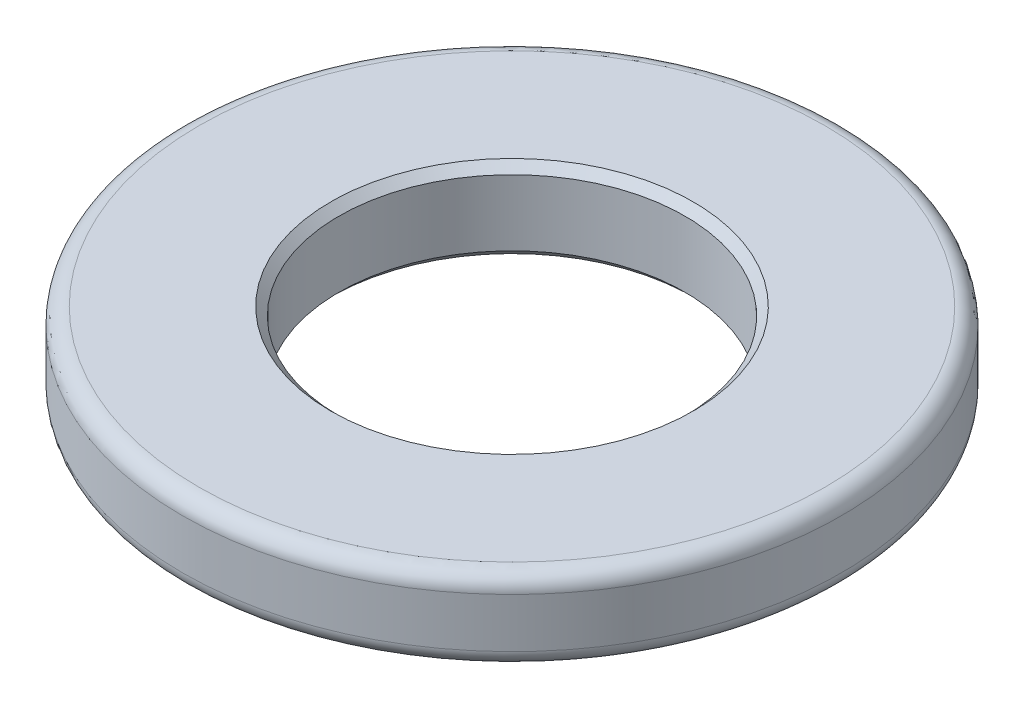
ISO-10303-21;
HEADER;
FILE_DESCRIPTION(('STEP AP214'),'2;1');
FILE_NAME('part.step','',(''),(''),'','','');
FILE_SCHEMA(('AUTOMOTIVE_DESIGN { 1 0 10303 214 1 1 1 1 }'));
ENDSEC;
DATA;
#1=APPLICATION_CONTEXT('core data for automotive mechanical design processes');
#2=APPLICATION_PROTOCOL_DEFINITION('international standard','automotive_design',2000,#1);
#3=PRODUCT_CONTEXT('',#1,'mechanical');
#4=PRODUCT('Part','Part','',(#3));
#5=PRODUCT_RELATED_PRODUCT_CATEGORY('part','',(#4));
#6=PRODUCT_DEFINITION_FORMATION('','',#4);
#7=PRODUCT_DEFINITION_CONTEXT('part definition',#1,'design');
#8=PRODUCT_DEFINITION('design','',#6,#7);
#9=PRODUCT_DEFINITION_SHAPE('','',#8);
#10=(LENGTH_UNIT() NAMED_UNIT(*) SI_UNIT(.MILLI.,.METRE.));
#11=(NAMED_UNIT(*) PLANE_ANGLE_UNIT() SI_UNIT($,.RADIAN.));
#12=(NAMED_UNIT(*) SI_UNIT($,.STERADIAN.) SOLID_ANGLE_UNIT());
#13=UNCERTAINTY_MEASURE_WITH_UNIT(LENGTH_MEASURE(1.E-05),#10,'distance_accuracy_value','');
#14=(GEOMETRIC_REPRESENTATION_CONTEXT(3) GLOBAL_UNCERTAINTY_ASSIGNED_CONTEXT((#13)) GLOBAL_UNIT_ASSIGNED_CONTEXT((#10,
#11,#12)) REPRESENTATION_CONTEXT('',''));
#15=CARTESIAN_POINT('',(0.,0.,0.));
#16=DIRECTION('',(0.,0.,1.));
#17=DIRECTION('',(1.,0.,0.));
#18=AXIS2_PLACEMENT_3D('',#15,#16,#17);
#19=CARTESIAN_POINT('',(0.,1.,0.));
#20=DIRECTION('',(0.,1.,0.));
#21=DIRECTION('',(0.,0.,1.));
#22=AXIS2_PLACEMENT_3D('',#19,#20,#21);
#23=PLANE('',#22);
#24=CARTESIAN_POINT('',(0.,1.,0.));
#25=DIRECTION('',(0.,1.,0.));
#26=DIRECTION('',(0.,0.,1.));
#27=AXIS2_PLACEMENT_3D('',#24,#25,#26);
#28=CIRCLE('',#27,2.2);
#29=CARTESIAN_POINT('',(0.,1.,2.2));
#30=VERTEX_POINT('',#29);
#31=EDGE_CURVE('E10',#30,#30,#28,.F.);
#32=ORIENTED_EDGE('',*,*,#31,.T.);
#33=EDGE_LOOP('',(#32));
#34=FACE_BOUND('',#33,.T.);
#35=CARTESIAN_POINT('',(0.,1.,0.));
#36=DIRECTION('',(0.,1.,0.));
#37=DIRECTION('',(0.,0.,1.));
#38=AXIS2_PLACEMENT_3D('',#35,#36,#37);
#39=CIRCLE('',#38,3.8);
#40=CARTESIAN_POINT('',(0.,1.,3.8));
#41=VERTEX_POINT('',#40);
#42=EDGE_CURVE('E48',#41,#41,#39,.T.);
#43=ORIENTED_EDGE('',*,*,#42,.T.);
#44=EDGE_LOOP('',(#43));
#45=FACE_BOUND('',#44,.T.);
#46=ADVANCED_FACE('F28',(#34,#45),#23,.T.);
#47=CARTESIAN_POINT('',(0.,0.,0.));
#48=DIRECTION('',(0.,1.,0.));
#49=DIRECTION('',(0.,0.,1.));
#50=AXIS2_PLACEMENT_3D('',#47,#48,#49);
#51=PLANE('',#50);
#52=CARTESIAN_POINT('',(0.,0.,0.));
#53=DIRECTION('',(0.,1.,0.));
#54=DIRECTION('',(0.,0.,1.));
#55=AXIS2_PLACEMENT_3D('',#52,#53,#54);
#56=CIRCLE('',#55,2.2);
#57=CARTESIAN_POINT('',(0.,0.,2.2));
#58=VERTEX_POINT('',#57);
#59=EDGE_CURVE('E43',#58,#58,#56,.T.);
#60=ORIENTED_EDGE('',*,*,#59,.T.);
#61=EDGE_LOOP('',(#60));
#62=FACE_BOUND('',#61,.T.);
#63=CARTESIAN_POINT('',(0.,0.,0.));
#64=DIRECTION('',(0.,1.,0.));
#65=DIRECTION('',(0.,0.,1.));
#66=AXIS2_PLACEMENT_3D('',#63,#64,#65);
#67=CIRCLE('',#66,3.8);
#68=CARTESIAN_POINT('',(0.,0.,3.8));
#69=VERTEX_POINT('',#68);
#70=EDGE_CURVE('E51',#69,#69,#67,.F.);
#71=ORIENTED_EDGE('',*,*,#70,.T.);
#72=EDGE_LOOP('',(#71));
#73=FACE_BOUND('',#72,.T.);
#74=ADVANCED_FACE('F72',(#62,#73),#51,.F.);
#75=CARTESIAN_POINT('',(0.,1.,0.));
#76=DIRECTION('',(0.,-1.,0.));
#77=DIRECTION('',(0.,0.,-1.));
#78=AXIS2_PLACEMENT_3D('',#75,#76,#77);
#79=CYLINDRICAL_SURFACE('',#78,4.);
#80=CARTESIAN_POINT('',(0.,0.2,0.));
#81=DIRECTION('',(0.,1.,0.));
#82=DIRECTION('',(0.,0.,1.));
#83=AXIS2_PLACEMENT_3D('',#80,#81,#82);
#84=CIRCLE('',#83,4.);
#85=CARTESIAN_POINT('',(0.,0.2,4.));
#86=VERTEX_POINT('',#85);
#87=EDGE_CURVE('E54',#86,#86,#84,.T.);
#88=ORIENTED_EDGE('',*,*,#87,.T.);
#89=EDGE_LOOP('',(#88));
#90=FACE_BOUND('',#89,.T.);
#91=CARTESIAN_POINT('',(0.,0.8,0.));
#92=DIRECTION('',(0.,1.,0.));
#93=DIRECTION('',(0.,0.,1.));
#94=AXIS2_PLACEMENT_3D('',#91,#92,#93);
#95=CIRCLE('',#94,4.);
#96=CARTESIAN_POINT('',(0.,0.8,4.));
#97=VERTEX_POINT('',#96);
#98=EDGE_CURVE('E57',#97,#97,#95,.F.);
#99=ORIENTED_EDGE('',*,*,#98,.T.);
#100=EDGE_LOOP('',(#99));
#101=FACE_BOUND('',#100,.T.);
#102=ADVANCED_FACE('F61',(#90,#101),#79,.T.);
#103=CARTESIAN_POINT('',(0.,1.,0.));
#104=DIRECTION('',(0.,-1.,0.));
#105=DIRECTION('',(0.,0.,-1.));
#106=AXIS2_PLACEMENT_3D('',#103,#104,#105);
#107=CYLINDRICAL_SURFACE('',#106,2.1);
#108=CARTESIAN_POINT('',(0.,0.099999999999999,0.));
#109=DIRECTION('',(0.,1.,0.));
#110=DIRECTION('',(0.,0.,1.));
#111=AXIS2_PLACEMENT_3D('',#108,#109,#110);
#112=CIRCLE('',#111,2.1);
#113=CARTESIAN_POINT('',(0.,0.099999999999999,2.1));
#114=VERTEX_POINT('',#113);
#115=EDGE_CURVE('E35',#114,#114,#112,.F.);
#116=ORIENTED_EDGE('',*,*,#115,.T.);
#117=EDGE_LOOP('',(#116));
#118=FACE_BOUND('',#117,.T.);
#119=CARTESIAN_POINT('',(0.,0.900000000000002,0.));
#120=DIRECTION('',(0.,1.,0.));
#121=DIRECTION('',(0.,0.,1.));
#122=AXIS2_PLACEMENT_3D('',#119,#120,#121);
#123=CIRCLE('',#122,2.1);
#124=CARTESIAN_POINT('',(0.,0.900000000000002,2.1));
#125=VERTEX_POINT('',#124);
#126=EDGE_CURVE('E39',#125,#125,#123,.T.);
#127=ORIENTED_EDGE('',*,*,#126,.T.);
#128=EDGE_LOOP('',(#127));
#129=FACE_BOUND('',#128,.T.);
#130=ADVANCED_FACE('F80',(#118,#129),#107,.F.);
#131=CARTESIAN_POINT('',(0.,0.2,0.));
#132=DIRECTION('',(0.,1.,0.));
#133=DIRECTION('',(0.,0.,1.));
#134=AXIS2_PLACEMENT_3D('',#131,#132,#133);
#135=TOROIDAL_SURFACE('',#134,3.8,0.2);
#136=ORIENTED_EDGE('',*,*,#70,.F.);
#137=EDGE_LOOP('',(#136));
#138=FACE_BOUND('',#137,.T.);
#139=ORIENTED_EDGE('',*,*,#87,.F.);
#140=EDGE_LOOP('',(#139));
#141=FACE_BOUND('',#140,.T.);
#142=ADVANCED_FACE('F67',(#138,#141),#135,.T.);
#143=CARTESIAN_POINT('',(0.,0.8,0.));
#144=DIRECTION('',(0.,1.,0.));
#145=DIRECTION('',(0.,0.,1.));
#146=AXIS2_PLACEMENT_3D('',#143,#144,#145);
#147=TOROIDAL_SURFACE('',#146,3.8,0.2);
#148=ORIENTED_EDGE('',*,*,#98,.F.);
#149=EDGE_LOOP('',(#148));
#150=FACE_BOUND('',#149,.T.);
#151=ORIENTED_EDGE('',*,*,#42,.F.);
#152=EDGE_LOOP('',(#151));
#153=FACE_BOUND('',#152,.T.);
#154=ADVANCED_FACE('F63',(#150,#153),#147,.T.);
#155=CARTESIAN_POINT('',(0.,0.,0.));
#156=DIRECTION('',(0.,-1.,0.));
#157=DIRECTION('',(0.,0.,-1.));
#158=AXIS2_PLACEMENT_3D('',#155,#156,#157);
#159=CONICAL_SURFACE('',#158,2.2,0.785398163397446);
#160=ORIENTED_EDGE('',*,*,#115,.F.);
#161=EDGE_LOOP('',(#160));
#162=FACE_BOUND('',#161,.T.);
#163=ORIENTED_EDGE('',*,*,#59,.F.);
#164=EDGE_LOOP('',(#163));
#165=FACE_BOUND('',#164,.T.);
#166=ADVANCED_FACE('F66',(#162,#165),#159,.F.);
#167=CARTESIAN_POINT('',(0.,0.900000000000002,0.));
#168=DIRECTION('',(0.,1.,0.));
#169=DIRECTION('',(0.,0.,1.));
#170=AXIS2_PLACEMENT_3D('',#167,#168,#169);
#171=CONICAL_SURFACE('',#170,2.1,0.785398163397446);
#172=ORIENTED_EDGE('',*,*,#31,.F.);
#173=EDGE_LOOP('',(#172));
#174=FACE_BOUND('',#173,.T.);
#175=ORIENTED_EDGE('',*,*,#126,.F.);
#176=EDGE_LOOP('',(#175));
#177=FACE_BOUND('',#176,.T.);
#178=ADVANCED_FACE('F30',(#174,#177),#171,.F.);
#179=CLOSED_SHELL('',(#46,#74,#102,#130,#142,#154,#166,#178));
#180=MANIFOLD_SOLID_BREP('B2',#179);
#181=ADVANCED_BREP_SHAPE_REPRESENTATION('',(#18,#180),#14);
#182=SHAPE_DEFINITION_REPRESENTATION(#9,#181);
ENDSEC;
END-ISO-10303-21;
